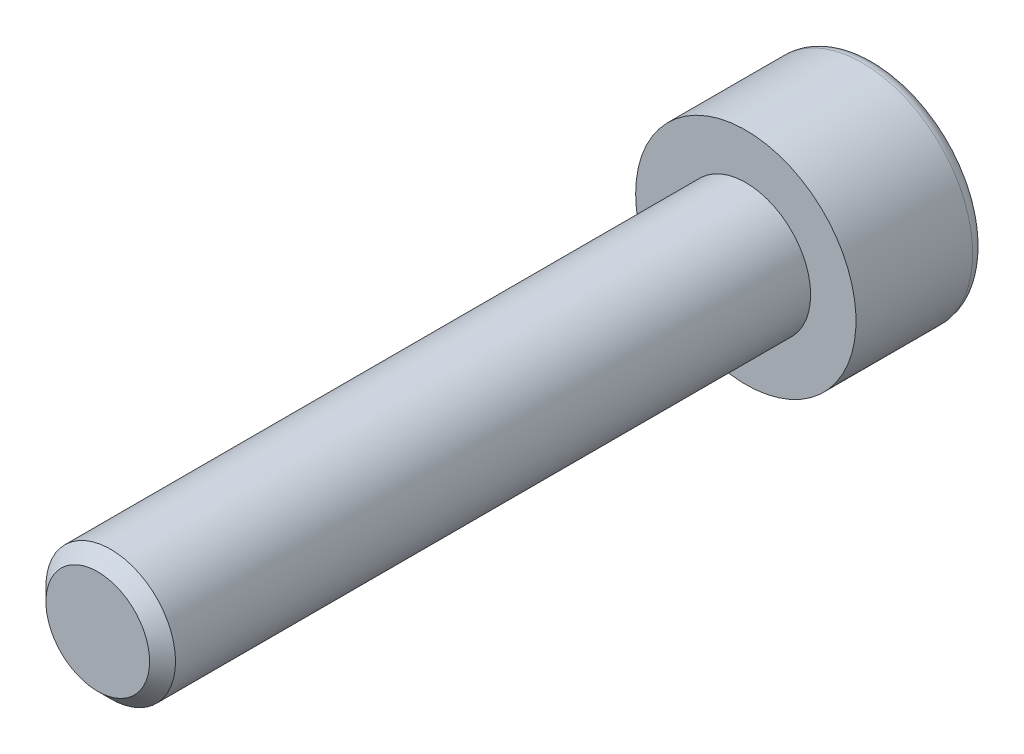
ISO-10303-21;
HEADER;
FILE_DESCRIPTION(('STEP AP214'),'2;1');
FILE_NAME('part.step','',(''),(''),'','','');
FILE_SCHEMA(('AUTOMOTIVE_DESIGN { 1 0 10303 214 1 1 1 1 }'));
ENDSEC;
DATA;
#1=APPLICATION_CONTEXT('core data for automotive mechanical design processes');
#2=APPLICATION_PROTOCOL_DEFINITION('international standard','automotive_design',2000,#1);
#3=PRODUCT_CONTEXT('',#1,'mechanical');
#4=PRODUCT('Part','Part','',(#3));
#5=PRODUCT_RELATED_PRODUCT_CATEGORY('part','',(#4));
#6=PRODUCT_DEFINITION_FORMATION('','',#4);
#7=PRODUCT_DEFINITION_CONTEXT('part definition',#1,'design');
#8=PRODUCT_DEFINITION('design','',#6,#7);
#9=PRODUCT_DEFINITION_SHAPE('','',#8);
#10=(LENGTH_UNIT() NAMED_UNIT(*) SI_UNIT(.MILLI.,.METRE.));
#11=(NAMED_UNIT(*) PLANE_ANGLE_UNIT() SI_UNIT($,.RADIAN.));
#12=(NAMED_UNIT(*) SI_UNIT($,.STERADIAN.) SOLID_ANGLE_UNIT());
#13=UNCERTAINTY_MEASURE_WITH_UNIT(LENGTH_MEASURE(1.E-05),#10,'distance_accuracy_value','');
#14=(GEOMETRIC_REPRESENTATION_CONTEXT(3) GLOBAL_UNCERTAINTY_ASSIGNED_CONTEXT((#13)) GLOBAL_UNIT_ASSIGNED_CONTEXT((#10,
#11,#12)) REPRESENTATION_CONTEXT('',''));
#15=CARTESIAN_POINT('',(0.,0.,0.));
#16=DIRECTION('',(0.,0.,1.));
#17=DIRECTION('',(1.,0.,0.));
#18=AXIS2_PLACEMENT_3D('',#15,#16,#17);
#19=CARTESIAN_POINT('',(0.,0.,-5.));
#20=DIRECTION('',(0.,0.,1.));
#21=DIRECTION('',(1.,0.,0.));
#22=AXIS2_PLACEMENT_3D('',#19,#20,#21);
#23=PLANE('',#22);
#24=CARTESIAN_POINT('',(0.,0.,-5.));
#25=DIRECTION('',(0.,0.,-1.));
#26=DIRECTION('',(-1.,0.,0.));
#27=AXIS2_PLACEMENT_3D('',#24,#25,#26);
#28=CIRCLE('',#27,3.75);
#29=CARTESIAN_POINT('',(-3.75,0.,-5.));
#30=VERTEX_POINT('',#29);
#31=EDGE_CURVE('E141',#30,#30,#28,.T.);
#32=ORIENTED_EDGE('',*,*,#31,.T.);
#33=EDGE_LOOP('',(#32));
#34=FACE_BOUND('',#33,.T.);
#35=DIRECTION('',(-0.86602540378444,0.499999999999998,0.));
#36=VECTOR('',#35,1.);
#37=CARTESIAN_POINT('',(0.,2.30940107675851,-5.));
#38=LINE('',#37,#36);
#39=CARTESIAN_POINT('',(2.,1.15470053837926,-5.));
#40=VERTEX_POINT('',#39);
#41=CARTESIAN_POINT('',(0.,2.30940107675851,-5.));
#42=VERTEX_POINT('',#41);
#43=EDGE_CURVE('E45',#40,#42,#38,.T.);
#44=ORIENTED_EDGE('',*,*,#43,.T.);
#45=DIRECTION('',(-0.866025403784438,-0.500000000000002,0.));
#46=VECTOR('',#45,1.);
#47=CARTESIAN_POINT('',(0.,2.30940107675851,-5.));
#48=LINE('',#47,#46);
#49=CARTESIAN_POINT('',(-2.,1.15470053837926,-5.));
#50=VERTEX_POINT('',#49);
#51=EDGE_CURVE('E85',#42,#50,#48,.T.);
#52=ORIENTED_EDGE('',*,*,#51,.T.);
#53=DIRECTION('',(0.,-1.,0.));
#54=VECTOR('',#53,1.);
#55=CARTESIAN_POINT('',(-2.,-1.15470053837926,-5.));
#56=LINE('',#55,#54);
#57=CARTESIAN_POINT('',(-2.,-1.15470053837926,-5.));
#58=VERTEX_POINT('',#57);
#59=EDGE_CURVE('E93',#50,#58,#56,.T.);
#60=ORIENTED_EDGE('',*,*,#59,.T.);
#61=DIRECTION('',(0.866025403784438,-0.500000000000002,0.));
#62=VECTOR('',#61,1.);
#63=CARTESIAN_POINT('',(0.,-2.30940107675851,-5.));
#64=LINE('',#63,#62);
#65=CARTESIAN_POINT('',(0.,-2.30940107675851,-5.));
#66=VERTEX_POINT('',#65);
#67=EDGE_CURVE('E111',#58,#66,#64,.T.);
#68=ORIENTED_EDGE('',*,*,#67,.T.);
#69=DIRECTION('',(0.86602540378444,0.499999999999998,0.));
#70=VECTOR('',#69,1.);
#71=CARTESIAN_POINT('',(0.,-2.30940107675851,-5.));
#72=LINE('',#71,#70);
#73=CARTESIAN_POINT('',(2.,-1.15470053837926,-5.));
#74=VERTEX_POINT('',#73);
#75=EDGE_CURVE('E114',#66,#74,#72,.T.);
#76=ORIENTED_EDGE('',*,*,#75,.T.);
#77=DIRECTION('',(0.,1.,0.));
#78=VECTOR('',#77,1.);
#79=CARTESIAN_POINT('',(2.,-1.15470053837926,-5.));
#80=LINE('',#79,#78);
#81=EDGE_CURVE('E104',#74,#40,#80,.T.);
#82=ORIENTED_EDGE('',*,*,#81,.T.);
#83=EDGE_LOOP('',(#44,#52,#60,#68,#76,#82));
#84=FACE_BOUND('',#83,.T.);
#85=ADVANCED_FACE('F31',(#34,#84),#23,.F.);
#86=CARTESIAN_POINT('',(0.,0.,-4.5));
#87=DIRECTION('',(0.,0.,-1.));
#88=DIRECTION('',(-1.,0.,0.));
#89=AXIS2_PLACEMENT_3D('',#86,#87,#88);
#90=TOROIDAL_SURFACE('',#89,3.75,0.5);
#91=ORIENTED_EDGE('',*,*,#31,.F.);
#92=EDGE_LOOP('',(#91));
#93=FACE_BOUND('',#92,.T.);
#94=CARTESIAN_POINT('',(0.,0.,-4.5));
#95=DIRECTION('',(0.,0.,-1.));
#96=DIRECTION('',(-1.,0.,0.));
#97=AXIS2_PLACEMENT_3D('',#94,#95,#96);
#98=CIRCLE('',#97,4.25);
#99=CARTESIAN_POINT('',(-4.25,0.,-4.5));
#100=VERTEX_POINT('',#99);
#101=EDGE_CURVE('E138',#100,#100,#98,.T.);
#102=ORIENTED_EDGE('',*,*,#101,.T.);
#103=EDGE_LOOP('',(#102));
#104=FACE_BOUND('',#103,.T.);
#105=ADVANCED_FACE('F160',(#93,#104),#90,.T.);
#106=CARTESIAN_POINT('',(0.,0.,0.));
#107=DIRECTION('',(0.,0.,-1.));
#108=DIRECTION('',(-1.,0.,0.));
#109=AXIS2_PLACEMENT_3D('',#106,#107,#108);
#110=CYLINDRICAL_SURFACE('',#109,4.25);
#111=ORIENTED_EDGE('',*,*,#101,.F.);
#112=EDGE_LOOP('',(#111));
#113=FACE_BOUND('',#112,.T.);
#114=CARTESIAN_POINT('',(0.,0.,0.));
#115=DIRECTION('',(0.,0.,-1.));
#116=DIRECTION('',(-1.,0.,0.));
#117=AXIS2_PLACEMENT_3D('',#114,#115,#116);
#118=CIRCLE('',#117,4.25);
#119=CARTESIAN_POINT('',(-4.25,0.,0.));
#120=VERTEX_POINT('',#119);
#121=EDGE_CURVE('E99',#120,#120,#118,.T.);
#122=ORIENTED_EDGE('',*,*,#121,.T.);
#123=EDGE_LOOP('',(#122));
#124=FACE_BOUND('',#123,.T.);
#125=ADVANCED_FACE('F165',(#113,#124),#110,.T.);
#126=CARTESIAN_POINT('',(0.,0.,0.));
#127=DIRECTION('',(0.,0.,-1.));
#128=DIRECTION('',(-1.,0.,0.));
#129=AXIS2_PLACEMENT_3D('',#126,#127,#128);
#130=PLANE('',#129);
#131=CARTESIAN_POINT('',(0.,0.,0.));
#132=DIRECTION('',(0.,0.,1.));
#133=DIRECTION('',(1.,0.,0.));
#134=AXIS2_PLACEMENT_3D('',#131,#132,#133);
#135=CIRCLE('',#134,2.5);
#136=CARTESIAN_POINT('',(2.5,0.,0.));
#137=VERTEX_POINT('',#136);
#138=EDGE_CURVE('E105',#137,#137,#135,.T.);
#139=ORIENTED_EDGE('',*,*,#138,.F.);
#140=EDGE_LOOP('',(#139));
#141=FACE_BOUND('',#140,.T.);
#142=ORIENTED_EDGE('',*,*,#121,.F.);
#143=EDGE_LOOP('',(#142));
#144=FACE_BOUND('',#143,.T.);
#145=ADVANCED_FACE('F173',(#141,#144),#130,.F.);
#146=CARTESIAN_POINT('',(0.,2.30940107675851,-2.5));
#147=DIRECTION('',(-0.499999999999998,-0.86602540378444,0.));
#148=DIRECTION('',(0.86602540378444,-0.499999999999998,0.));
#149=AXIS2_PLACEMENT_3D('',#146,#147,#148);
#150=PLANE('',#149);
#151=ORIENTED_EDGE('',*,*,#43,.F.);
#152=DIRECTION('',(0.,0.,-1.));
#153=VECTOR('',#152,1.);
#154=CARTESIAN_POINT('',(2.,1.15470053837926,-2.5));
#155=LINE('',#154,#153);
#156=CARTESIAN_POINT('',(2.,1.15470053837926,-2.5));
#157=VERTEX_POINT('',#156);
#158=EDGE_CURVE('E127',#157,#40,#155,.T.);
#159=ORIENTED_EDGE('',*,*,#158,.F.);
#160=DIRECTION('',(-0.86602540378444,0.499999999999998,0.));
#161=VECTOR('',#160,1.);
#162=CARTESIAN_POINT('',(0.,2.30940107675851,-2.5));
#163=LINE('',#162,#161);
#164=CARTESIAN_POINT('',(0.,2.30940107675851,-2.5));
#165=VERTEX_POINT('',#164);
#166=EDGE_CURVE('E98',#157,#165,#163,.T.);
#167=ORIENTED_EDGE('',*,*,#166,.T.);
#168=DIRECTION('',(0.,0.,-1.));
#169=VECTOR('',#168,1.);
#170=CARTESIAN_POINT('',(0.,2.30940107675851,-2.5));
#171=LINE('',#170,#169);
#172=EDGE_CURVE('E87',#165,#42,#171,.T.);
#173=ORIENTED_EDGE('',*,*,#172,.T.);
#174=EDGE_LOOP('',(#151,#159,#167,#173));
#175=FACE_BOUND('',#174,.T.);
#176=ADVANCED_FACE('F96',(#175),#150,.T.);
#177=CARTESIAN_POINT('',(0.,2.30940107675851,-2.5));
#178=DIRECTION('',(0.500000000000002,-0.866025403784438,0.));
#179=DIRECTION('',(0.866025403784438,0.500000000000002,0.));
#180=AXIS2_PLACEMENT_3D('',#177,#178,#179);
#181=PLANE('',#180);
#182=ORIENTED_EDGE('',*,*,#51,.F.);
#183=ORIENTED_EDGE('',*,*,#172,.F.);
#184=DIRECTION('',(-0.866025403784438,-0.500000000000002,0.));
#185=VECTOR('',#184,1.);
#186=CARTESIAN_POINT('',(0.,2.30940107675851,-2.5));
#187=LINE('',#186,#185);
#188=CARTESIAN_POINT('',(-2.,1.15470053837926,-2.5));
#189=VERTEX_POINT('',#188);
#190=EDGE_CURVE('E118',#165,#189,#187,.T.);
#191=ORIENTED_EDGE('',*,*,#190,.T.);
#192=DIRECTION('',(0.,0.,-1.));
#193=VECTOR('',#192,1.);
#194=CARTESIAN_POINT('',(-2.,1.15470053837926,-2.5));
#195=LINE('',#194,#193);
#196=EDGE_CURVE('E89',#189,#50,#195,.T.);
#197=ORIENTED_EDGE('',*,*,#196,.T.);
#198=EDGE_LOOP('',(#182,#183,#191,#197));
#199=FACE_BOUND('',#198,.T.);
#200=ADVANCED_FACE('F86',(#199),#181,.T.);
#201=CARTESIAN_POINT('',(-2.,-1.15470053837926,-2.5));
#202=DIRECTION('',(1.,0.,0.));
#203=DIRECTION('',(0.,0.,-1.));
#204=AXIS2_PLACEMENT_3D('',#201,#202,#203);
#205=PLANE('',#204);
#206=ORIENTED_EDGE('',*,*,#59,.F.);
#207=ORIENTED_EDGE('',*,*,#196,.F.);
#208=DIRECTION('',(0.,-1.,0.));
#209=VECTOR('',#208,1.);
#210=CARTESIAN_POINT('',(-2.,-1.15470053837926,-2.5));
#211=LINE('',#210,#209);
#212=CARTESIAN_POINT('',(-2.,-1.15470053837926,-2.5));
#213=VERTEX_POINT('',#212);
#214=EDGE_CURVE('E120',#189,#213,#211,.T.);
#215=ORIENTED_EDGE('',*,*,#214,.T.);
#216=DIRECTION('',(0.,0.,-1.));
#217=VECTOR('',#216,1.);
#218=CARTESIAN_POINT('',(-2.,-1.15470053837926,-2.5));
#219=LINE('',#218,#217);
#220=EDGE_CURVE('E133',#213,#58,#219,.T.);
#221=ORIENTED_EDGE('',*,*,#220,.T.);
#222=EDGE_LOOP('',(#206,#207,#215,#221));
#223=FACE_BOUND('',#222,.T.);
#224=ADVANCED_FACE('F188',(#223),#205,.T.);
#225=CARTESIAN_POINT('',(0.,-2.30940107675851,-2.5));
#226=DIRECTION('',(0.500000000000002,0.866025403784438,0.));
#227=DIRECTION('',(-0.866025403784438,0.500000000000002,0.));
#228=AXIS2_PLACEMENT_3D('',#225,#226,#227);
#229=PLANE('',#228);
#230=ORIENTED_EDGE('',*,*,#67,.F.);
#231=ORIENTED_EDGE('',*,*,#220,.F.);
#232=DIRECTION('',(0.866025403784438,-0.500000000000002,0.));
#233=VECTOR('',#232,1.);
#234=CARTESIAN_POINT('',(0.,-2.30940107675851,-2.5));
#235=LINE('',#234,#233);
#236=CARTESIAN_POINT('',(0.,-2.30940107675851,-2.5));
#237=VERTEX_POINT('',#236);
#238=EDGE_CURVE('E122',#213,#237,#235,.T.);
#239=ORIENTED_EDGE('',*,*,#238,.T.);
#240=DIRECTION('',(0.,0.,-1.));
#241=VECTOR('',#240,1.);
#242=CARTESIAN_POINT('',(0.,-2.30940107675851,-2.5));
#243=LINE('',#242,#241);
#244=EDGE_CURVE('E131',#237,#66,#243,.T.);
#245=ORIENTED_EDGE('',*,*,#244,.T.);
#246=EDGE_LOOP('',(#230,#231,#239,#245));
#247=FACE_BOUND('',#246,.T.);
#248=ADVANCED_FACE('F191',(#247),#229,.T.);
#249=CARTESIAN_POINT('',(0.,-2.30940107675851,-2.5));
#250=DIRECTION('',(-0.499999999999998,0.86602540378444,0.));
#251=DIRECTION('',(-0.86602540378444,-0.499999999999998,0.));
#252=AXIS2_PLACEMENT_3D('',#249,#250,#251);
#253=PLANE('',#252);
#254=ORIENTED_EDGE('',*,*,#75,.F.);
#255=ORIENTED_EDGE('',*,*,#244,.F.);
#256=DIRECTION('',(0.86602540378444,0.499999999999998,0.));
#257=VECTOR('',#256,1.);
#258=CARTESIAN_POINT('',(0.,-2.30940107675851,-2.5));
#259=LINE('',#258,#257);
#260=CARTESIAN_POINT('',(2.,-1.15470053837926,-2.5));
#261=VERTEX_POINT('',#260);
#262=EDGE_CURVE('E124',#237,#261,#259,.T.);
#263=ORIENTED_EDGE('',*,*,#262,.T.);
#264=DIRECTION('',(0.,0.,-1.));
#265=VECTOR('',#264,1.);
#266=CARTESIAN_POINT('',(2.,-1.15470053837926,-2.5));
#267=LINE('',#266,#265);
#268=EDGE_CURVE('E129',#261,#74,#267,.T.);
#269=ORIENTED_EDGE('',*,*,#268,.T.);
#270=EDGE_LOOP('',(#254,#255,#263,#269));
#271=FACE_BOUND('',#270,.T.);
#272=ADVANCED_FACE('F195',(#271),#253,.T.);
#273=CARTESIAN_POINT('',(2.,-1.15470053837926,-2.5));
#274=DIRECTION('',(-1.,0.,0.));
#275=DIRECTION('',(0.,0.,1.));
#276=AXIS2_PLACEMENT_3D('',#273,#274,#275);
#277=PLANE('',#276);
#278=ORIENTED_EDGE('',*,*,#81,.F.);
#279=ORIENTED_EDGE('',*,*,#268,.F.);
#280=DIRECTION('',(0.,1.,0.));
#281=VECTOR('',#280,1.);
#282=CARTESIAN_POINT('',(2.,-1.15470053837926,-2.5));
#283=LINE('',#282,#281);
#284=EDGE_CURVE('E52',#261,#157,#283,.T.);
#285=ORIENTED_EDGE('',*,*,#284,.T.);
#286=ORIENTED_EDGE('',*,*,#158,.T.);
#287=EDGE_LOOP('',(#278,#279,#285,#286));
#288=FACE_BOUND('',#287,.T.);
#289=ADVANCED_FACE('F199',(#288),#277,.T.);
#290=CARTESIAN_POINT('',(2.,1.15470053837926,-2.5));
#291=DIRECTION('',(0.,0.,1.));
#292=DIRECTION('',(1.,0.,0.));
#293=AXIS2_PLACEMENT_3D('',#290,#291,#292);
#294=PLANE('',#293);
#295=ORIENTED_EDGE('',*,*,#166,.F.);
#296=ORIENTED_EDGE('',*,*,#284,.F.);
#297=ORIENTED_EDGE('',*,*,#262,.F.);
#298=ORIENTED_EDGE('',*,*,#238,.F.);
#299=ORIENTED_EDGE('',*,*,#214,.F.);
#300=ORIENTED_EDGE('',*,*,#190,.F.);
#301=EDGE_LOOP('',(#295,#296,#297,#298,#299,#300));
#302=FACE_BOUND('',#301,.T.);
#303=ADVANCED_FACE('F203',(#302),#294,.F.);
#304=CARTESIAN_POINT('',(0.,0.,25.));
#305=DIRECTION('',(0.,0.,1.));
#306=DIRECTION('',(1.,0.,0.));
#307=AXIS2_PLACEMENT_3D('',#304,#305,#306);
#308=PLANE('',#307);
#309=CARTESIAN_POINT('',(0.,0.,25.));
#310=DIRECTION('',(0.,0.,1.));
#311=DIRECTION('',(1.,0.,0.));
#312=AXIS2_PLACEMENT_3D('',#309,#310,#311);
#313=CIRCLE('',#312,2.);
#314=CARTESIAN_POINT('',(2.,0.,25.));
#315=VERTEX_POINT('',#314);
#316=EDGE_CURVE('E38',#315,#315,#313,.T.);
#317=ORIENTED_EDGE('',*,*,#316,.T.);
#318=EDGE_LOOP('',(#317));
#319=FACE_BOUND('',#318,.T.);
#320=ADVANCED_FACE('F146',(#319),#308,.T.);
#321=CARTESIAN_POINT('',(0.,0.,0.));
#322=DIRECTION('',(0.,0.,1.));
#323=DIRECTION('',(1.,0.,0.));
#324=AXIS2_PLACEMENT_3D('',#321,#322,#323);
#325=CYLINDRICAL_SURFACE('',#324,2.5);
#326=CARTESIAN_POINT('',(0.,0.,24.5));
#327=DIRECTION('',(0.,0.,1.));
#328=DIRECTION('',(1.,0.,0.));
#329=AXIS2_PLACEMENT_3D('',#326,#327,#328);
#330=CIRCLE('',#329,2.5);
#331=CARTESIAN_POINT('',(2.5,0.,24.5));
#332=VERTEX_POINT('',#331);
#333=EDGE_CURVE('E11',#332,#332,#330,.F.);
#334=ORIENTED_EDGE('',*,*,#333,.T.);
#335=EDGE_LOOP('',(#334));
#336=FACE_BOUND('',#335,.T.);
#337=ORIENTED_EDGE('',*,*,#138,.T.);
#338=EDGE_LOOP('',(#337));
#339=FACE_BOUND('',#338,.T.);
#340=ADVANCED_FACE('F150',(#336,#339),#325,.T.);
#341=CARTESIAN_POINT('',(0.,0.,25.));
#342=DIRECTION('',(0.,0.,-1.));
#343=DIRECTION('',(-1.,0.,0.));
#344=AXIS2_PLACEMENT_3D('',#341,#342,#343);
#345=CONICAL_SURFACE('',#344,2.,0.785398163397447);
#346=ORIENTED_EDGE('',*,*,#333,.F.);
#347=EDGE_LOOP('',(#346));
#348=FACE_BOUND('',#347,.T.);
#349=ORIENTED_EDGE('',*,*,#316,.F.);
#350=EDGE_LOOP('',(#349));
#351=FACE_BOUND('',#350,.T.);
#352=ADVANCED_FACE('F148',(#348,#351),#345,.T.);
#353=CLOSED_SHELL('',(#85,#105,#125,#145,#176,#200,#224,#248,#272,#289,#303,#320,#340,#352));
#354=MANIFOLD_SOLID_BREP('B2',#353);
#355=ADVANCED_BREP_SHAPE_REPRESENTATION('',(#18,#354),#14);
#356=SHAPE_DEFINITION_REPRESENTATION(#9,#355);
ENDSEC;
END-ISO-10303-21;
